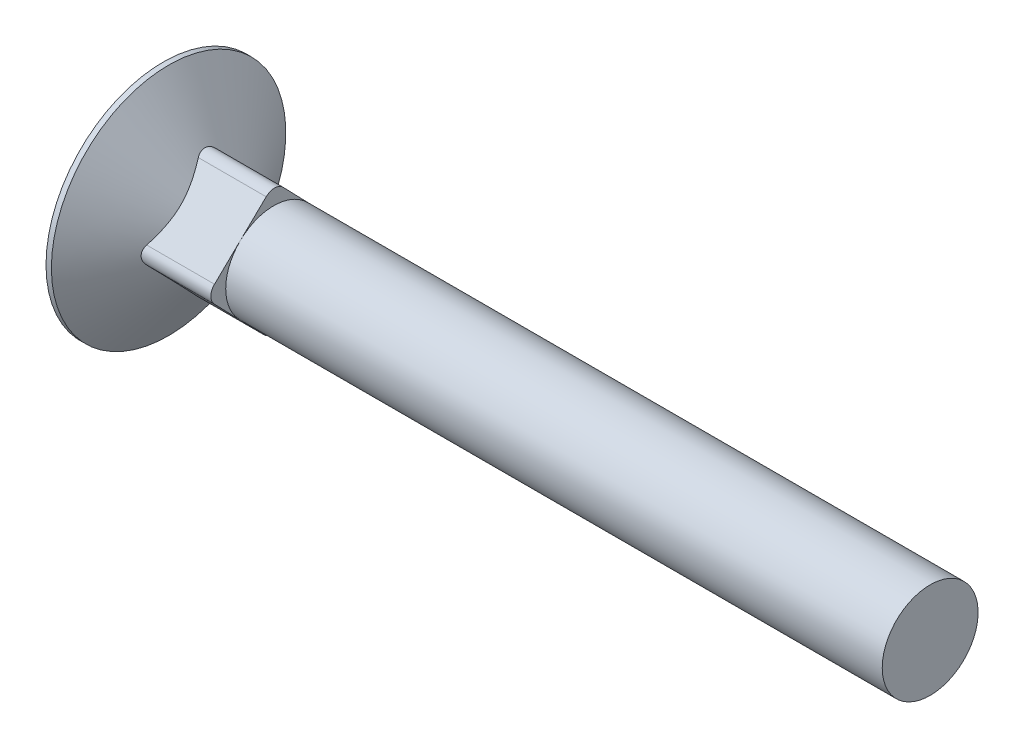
ISO-10303-21;
HEADER;
FILE_DESCRIPTION(('STEP AP214'),'2;1');
FILE_NAME('part.step','',(''),(''),'','','');
FILE_SCHEMA(('AUTOMOTIVE_DESIGN { 1 0 10303 214 1 1 1 1 }'));
ENDSEC;
DATA;
#1=APPLICATION_CONTEXT('core data for automotive mechanical design processes');
#2=APPLICATION_PROTOCOL_DEFINITION('international standard','automotive_design',2000,#1);
#3=PRODUCT_CONTEXT('',#1,'mechanical');
#4=PRODUCT('Part','Part','',(#3));
#5=PRODUCT_RELATED_PRODUCT_CATEGORY('part','',(#4));
#6=PRODUCT_DEFINITION_FORMATION('','',#4);
#7=PRODUCT_DEFINITION_CONTEXT('part definition',#1,'design');
#8=PRODUCT_DEFINITION('design','',#6,#7);
#9=PRODUCT_DEFINITION_SHAPE('','',#8);
#10=(LENGTH_UNIT() NAMED_UNIT(*) SI_UNIT(.MILLI.,.METRE.));
#11=(NAMED_UNIT(*) PLANE_ANGLE_UNIT() SI_UNIT($,.RADIAN.));
#12=(NAMED_UNIT(*) SI_UNIT($,.STERADIAN.) SOLID_ANGLE_UNIT());
#13=UNCERTAINTY_MEASURE_WITH_UNIT(LENGTH_MEASURE(1.E-05),#10,'distance_accuracy_value','');
#14=(GEOMETRIC_REPRESENTATION_CONTEXT(3) GLOBAL_UNCERTAINTY_ASSIGNED_CONTEXT((#13)) GLOBAL_UNIT_ASSIGNED_CONTEXT((#10,
#11,#12)) REPRESENTATION_CONTEXT('',''));
#15=CARTESIAN_POINT('',(0.,0.,0.));
#16=DIRECTION('',(0.,0.,1.));
#17=DIRECTION('',(1.,0.,0.));
#18=AXIS2_PLACEMENT_3D('',#15,#16,#17);
#19=CARTESIAN_POINT('',(0.533667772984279,0.,0.));
#20=DIRECTION('',(-1.,0.,0.));
#21=DIRECTION('',(0.,0.,1.));
#22=AXIS2_PLACEMENT_3D('',#19,#20,#21);
#23=CONICAL_SURFACE('',#22,11.6459,0.99483767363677);
#24=CARTESIAN_POINT('',(0.533667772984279,0.,0.));
#25=DIRECTION('',(-1.,0.,0.));
#26=DIRECTION('',(0.,0.,1.));
#27=AXIS2_PLACEMENT_3D('',#24,#25,#26);
#28=CIRCLE('',#27,11.6459);
#29=CARTESIAN_POINT('',(0.533667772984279,0.,11.6459));
#30=VERTEX_POINT('',#29);
#31=EDGE_CURVE('E218',#30,#30,#28,.T.);
#32=ORIENTED_EDGE('',*,*,#31,.F.);
#33=EDGE_LOOP('',(#32));
#34=FACE_BOUND('',#33,.T.);
#35=CARTESIAN_POINT('',(0.532123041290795,-10.9550309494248,-3.95849631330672));
#36=CARTESIAN_POINT('',(0.694883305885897,-10.7574427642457,-3.76768762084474));
#37=CARTESIAN_POINT('',(0.856904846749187,-10.559536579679,-3.57657183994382));
#38=CARTESIAN_POINT('',(1.17901780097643,-10.1628911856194,-3.19353583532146));
#39=CARTESIAN_POINT('',(1.33910905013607,-9.96415190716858,-3.00161554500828));
#40=CARTESIAN_POINT('',(1.65750023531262,-9.56490022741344,-2.61606267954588));
#41=CARTESIAN_POINT('',(1.815790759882,-9.36438393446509,-2.42242634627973));
#42=CARTESIAN_POINT('',(2.12924998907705,-8.96210112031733,-2.03394634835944));
#43=CARTESIAN_POINT('',(2.28441881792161,-8.76033464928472,-1.8391027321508));
#44=CARTESIAN_POINT('',(2.60253582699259,-8.33956733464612,-1.43277245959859));
#45=CARTESIAN_POINT('',(2.76515930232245,-8.12043891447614,-1.22116260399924));
#46=CARTESIAN_POINT('',(3.08403633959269,-7.67975137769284,-0.795595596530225));
#47=CARTESIAN_POINT('',(3.24028905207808,-7.45819194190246,-0.581638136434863));
#48=CARTESIAN_POINT('',(3.54365698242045,-7.01226444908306,-0.151010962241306));
#49=CARTESIAN_POINT('',(3.69078656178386,-6.78790151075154,0.0656538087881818));
#50=CARTESIAN_POINT('',(3.9018860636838,-6.4482959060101,0.393607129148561));
#51=CARTESIAN_POINT('',(3.97064730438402,-6.33459485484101,0.503406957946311));
#52=CARTESIAN_POINT('',(4.10429383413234,-6.10602334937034,0.724135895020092));
#53=CARTESIAN_POINT('',(4.16917940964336,-5.99115298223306,0.835064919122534));
#54=CARTESIAN_POINT('',(4.28177385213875,-5.78317650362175,1.03590546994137));
#55=CARTESIAN_POINT('',(4.33032469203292,-5.69030669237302,1.12558880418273));
#56=CARTESIAN_POINT('',(4.42392347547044,-5.50366905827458,1.30582267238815));
#57=CARTESIAN_POINT('',(4.46897188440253,-5.40990135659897,1.39637308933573));
#58=CARTESIAN_POINT('',(4.55500361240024,-5.22139771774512,1.57840893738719));
#59=CARTESIAN_POINT('',(4.59598693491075,-5.12666178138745,1.66989436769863));
#60=CARTESIAN_POINT('',(4.67326581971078,-4.93616450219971,1.85385545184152));
#61=CARTESIAN_POINT('',(4.70955912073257,-4.84040268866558,1.94633156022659));
#62=CARTESIAN_POINT('',(4.8091295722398,-4.55502583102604,2.22191678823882));
#63=CARTESIAN_POINT('',(4.86468926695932,-4.36393297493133,2.40645301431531));
#64=CARTESIAN_POINT('',(4.92839312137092,-4.07513434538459,2.68534260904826));
#65=CARTESIAN_POINT('',(4.94635423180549,-3.97851895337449,2.778643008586));
#66=CARTESIAN_POINT('',(4.97522467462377,-3.78474984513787,2.96576366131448));
#67=CARTESIAN_POINT('',(4.98613520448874,-3.68759622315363,3.05958382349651));
#68=CARTESIAN_POINT('',(5.00114339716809,-3.48493042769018,3.25529590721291));
#69=CARTESIAN_POINT('',(5.00460096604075,-3.37939330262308,3.35721192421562));
#70=CARTESIAN_POINT('',(5.00268671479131,-3.16837391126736,3.56099098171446));
#71=CARTESIAN_POINT('',(4.99731590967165,-3.06289164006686,3.66285402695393));
#72=CARTESIAN_POINT('',(4.9779534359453,-2.85227904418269,3.86624024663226));
#73=CARTESIAN_POINT('',(4.96395674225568,-2.74714896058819,3.96776318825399));
#74=CARTESIAN_POINT('',(4.92786642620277,-2.53761848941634,4.17010441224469));
#75=CARTESIAN_POINT('',(4.90577242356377,-2.43321813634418,4.27092266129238));
#76=CARTESIAN_POINT('',(4.82813110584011,-2.12026583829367,4.57313718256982));
#77=CARTESIAN_POINT('',(4.76134680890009,-1.91314141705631,4.77315491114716));
#78=CARTESIAN_POINT('',(4.60493800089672,-1.50360200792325,5.16864252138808));
#79=CARTESIAN_POINT('',(4.51531621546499,-1.30118646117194,5.36411294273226));
#80=CARTESIAN_POINT('',(4.38782773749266,-1.04048098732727,5.61587329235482));
#81=CARTESIAN_POINT('',(4.35750714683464,-0.980222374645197,5.67406435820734));
#82=CARTESIAN_POINT('',(4.29557102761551,-0.860252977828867,5.78991745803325));
#83=CARTESIAN_POINT('',(4.26395962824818,-0.800541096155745,5.84758055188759));
#84=CARTESIAN_POINT('',(4.13398057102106,-0.560445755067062,6.07943792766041));
#85=CARTESIAN_POINT('',(4.03052564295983,-0.381483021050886,6.25226023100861));
#86=CARTESIAN_POINT('',(3.81514593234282,-0.0262023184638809,6.59535081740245));
#87=CARTESIAN_POINT('',(3.70321920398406,0.150115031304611,6.76561850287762));
#88=CARTESIAN_POINT('',(3.47287138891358,0.500787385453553,7.10425885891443));
#89=CARTESIAN_POINT('',(3.35444275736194,0.675139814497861,7.27262904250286));
#90=CARTESIAN_POINT('',(3.11274095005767,1.02207115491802,7.60765674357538));
#91=CARTESIAN_POINT('',(2.98946819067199,1.1946502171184,7.77431440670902));
#92=CARTESIAN_POINT('',(2.73739552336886,1.54081564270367,8.10860247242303));
#93=CARTESIAN_POINT('',(2.6085421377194,1.71438179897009,8.27621336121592));
#94=CARTESIAN_POINT('',(2.34779855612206,2.06033522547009,8.61029670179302));
#95=CARTESIAN_POINT('',(2.21590824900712,2.23272245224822,8.77676911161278));
#96=CARTESIAN_POINT('',(1.95011606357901,2.57601874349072,9.10828648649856));
#97=CARTESIAN_POINT('',(1.81622133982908,2.74693068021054,9.27333422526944));
#98=CARTESIAN_POINT('',(1.54648946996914,3.08793964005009,9.60264274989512));
#99=CARTESIAN_POINT('',(1.41065250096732,3.2580367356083,9.76690360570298));
#100=CARTESIAN_POINT('',(1.27405768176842,3.42781483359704,9.93085640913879));
#101=B_SPLINE_CURVE_WITH_KNOTS('',3,(#35,#36,#37,#38,#39,#40,#41,#42,#43,#44,#45,#46,#47,#48,
#49,#50,#51,#52,#53,#54,#55,#56,#57,#58,#59,#60,#61,#62,#63,#64,#65,#66,#67,#68,#69,#70,#71,#72,
#73,#74,#75,#76,#77,#78,#79,#80,#81,#82,#83,#84,#85,#86,#87,#88,#89,#90,#91,#92,#93,#94,#95,#96,
#97,#98,#99,#100),.UNSPECIFIED.,.F.,.F.,(4,2,2,2,2,2,2,2,2,2,2,2,2,2,2,2,2,2,2,2,2,2,2,2,2,2,2,
2,2,2,2,2,4),(0.,0.95784549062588,1.91577189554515,2.87743116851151,3.83905209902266,
4.87493924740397,5.91096406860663,6.94531427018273,7.46239051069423,7.97942848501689,
8.39318007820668,8.80687659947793,9.22057277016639,9.63446766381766,10.4473829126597,
10.8537514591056,11.2600509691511,11.7000480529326,12.1399945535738,12.5801975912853,
13.0204213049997,13.9057728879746,14.7910188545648,15.0582778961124,15.3247403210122,
16.1328150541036,16.941075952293,17.7502954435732,18.5594455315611,19.3800254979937,
20.2006355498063,21.0188034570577,21.8368972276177),.UNSPECIFIED.);
#102=CARTESIAN_POINT('',(4.23183585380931,-5.87541843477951,0.946828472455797));
#103=VERTEX_POINT('',#102);
#104=CARTESIAN_POINT('',(4.23183585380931,-0.741202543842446,5.90488312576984));
#105=VERTEX_POINT('',#104);
#106=EDGE_CURVE('E220',#103,#105,#101,.T.);
#107=ORIENTED_EDGE('',*,*,#106,.T.);
#108=CARTESIAN_POINT('',(4.37943289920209,-0.944352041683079,5.64550263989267));
#109=CARTESIAN_POINT('',(4.35251225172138,-0.917354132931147,5.69204724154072));
#110=CARTESIAN_POINT('',(4.32662869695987,-0.886884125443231,5.73724384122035));
#111=CARTESIAN_POINT('',(4.27730445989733,-0.819163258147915,5.82401425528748));
#112=CARTESIAN_POINT('',(4.25387265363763,-0.781889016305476,5.86557482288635));
#113=CARTESIAN_POINT('',(4.20811926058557,-0.697414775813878,5.94718776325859));
#114=CARTESIAN_POINT('',(4.18606893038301,-0.649635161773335,5.98679887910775));
#115=CARTESIAN_POINT('',(4.1461706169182,-0.547346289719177,6.05870307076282));
#116=CARTESIAN_POINT('',(4.12831825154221,-0.49284414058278,6.09100377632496));
#117=CARTESIAN_POINT('',(4.09731214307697,-0.378030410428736,6.14704165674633));
#118=CARTESIAN_POINT('',(4.08417889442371,-0.317694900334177,6.1707414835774));
#119=CARTESIAN_POINT('',(4.06322968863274,-0.193106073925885,6.2081677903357));
#120=CARTESIAN_POINT('',(4.05541340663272,-0.128852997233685,6.22189487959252));
#121=CARTESIAN_POINT('',(4.04574485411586,-0.002640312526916,6.23807479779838));
#122=CARTESIAN_POINT('',(4.04354853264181,0.0592095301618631,6.24118215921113));
#123=CARTESIAN_POINT('',(4.04420106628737,0.182610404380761,6.23778541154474));
#124=CARTESIAN_POINT('',(4.04704886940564,0.244161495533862,6.23128330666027));
#125=CARTESIAN_POINT('',(4.05748932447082,0.362978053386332,6.20936879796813));
#126=CARTESIAN_POINT('',(4.06491236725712,0.420318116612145,6.19427631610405));
#127=CARTESIAN_POINT('',(4.0840854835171,0.531468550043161,6.15609939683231));
#128=CARTESIAN_POINT('',(4.09583456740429,0.585279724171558,6.13301678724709));
#129=CARTESIAN_POINT('',(4.12522430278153,0.695392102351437,6.0760331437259));
#130=CARTESIAN_POINT('',(4.14345974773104,0.750985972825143,6.04106952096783));
#131=CARTESIAN_POINT('',(4.1844626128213,0.854790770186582,5.96348587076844));
#132=CARTESIAN_POINT('',(4.20724090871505,0.902983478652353,5.92084749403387));
#133=CARTESIAN_POINT('',(4.26048053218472,0.997893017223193,5.82250913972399));
#134=CARTESIAN_POINT('',(4.29158558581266,1.0432204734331,5.7658090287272));
#135=CARTESIAN_POINT('',(4.34119373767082,1.10229290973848,5.6768498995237));
#136=CARTESIAN_POINT('',(4.35819619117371,1.12047838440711,5.64658957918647));
#137=CARTESIAN_POINT('',(4.39308026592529,1.15391048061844,5.58501172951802));
#138=CARTESIAN_POINT('',(4.41096112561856,1.16915959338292,5.55369512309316));
#139=CARTESIAN_POINT('',(4.42923880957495,1.18295598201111,5.52195706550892));
#140=B_SPLINE_CURVE_WITH_KNOTS('',3,(#108,#109,#110,#111,#112,#113,#114,#115,#116,#117,#118,
#119,#120,#121,#122,#123,#124,#125,#126,#127,#128,#129,#130,#131,#132,#133,#134,#135,#136,#137,
#138,#139),.UNSPECIFIED.,.F.,.F.,(4,2,2,2,2,2,2,2,2,2,2,2,2,2,2,4),(0.,0.180452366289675,
0.361536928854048,0.558281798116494,0.754820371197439,0.952202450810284,1.14957246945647,
1.33453429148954,1.51945754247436,1.69790657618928,1.87631481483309,2.07971777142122,
2.28361365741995,2.51914795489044,2.63659303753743,2.75393803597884),.UNSPECIFIED.);
#141=CARTESIAN_POINT('',(4.23183585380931,0.946828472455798,5.87541843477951));
#142=VERTEX_POINT('',#141);
#143=EDGE_CURVE('E11',#105,#142,#140,.T.);
#144=ORIENTED_EDGE('',*,*,#143,.T.);
#145=CARTESIAN_POINT('',(4.23172373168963,0.946628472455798,5.87562554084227));
#146=CARTESIAN_POINT('',(4.23172501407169,0.946630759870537,5.87562317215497));
#147=CARTESIAN_POINT('',(4.23172629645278,0.94663304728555,5.87562080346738));
#148=CARTESIAN_POINT('',(4.33105429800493,1.12380702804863,5.69215177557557));
#149=CARTESIAN_POINT('',(4.42452513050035,1.30262022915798,5.50698528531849));
#150=CARTESIAN_POINT('',(4.59558532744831,1.66399022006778,5.13277570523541));
#151=CARTESIAN_POINT('',(4.67316867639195,1.84654839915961,4.94373117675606));
#152=CARTESIAN_POINT('',(4.80695165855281,2.21499956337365,4.56218882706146));
#153=CARTESIAN_POINT('',(4.86321175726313,2.40088152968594,4.36970241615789));
#154=CARTESIAN_POINT('',(4.92769282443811,2.68184225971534,4.07875906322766));
#155=CARTESIAN_POINT('',(4.94586710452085,2.77583793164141,3.98142369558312));
#156=CARTESIAN_POINT('',(4.97506088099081,2.96435811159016,3.78620533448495));
#157=CARTESIAN_POINT('',(4.98608152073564,3.05888253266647,3.68832243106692));
#158=CARTESIAN_POINT('',(5.00115348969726,3.25542884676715,3.48479276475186));
#159=CARTESIAN_POINT('',(5.00460972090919,3.35747316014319,3.37912278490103));
#160=CARTESIAN_POINT('',(5.00267047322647,3.56152198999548,3.16782403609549));
#161=CARTESIAN_POINT('',(4.99727481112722,3.66352650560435,3.06219526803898));
#162=CARTESIAN_POINT('',(4.97783944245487,3.86719479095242,2.8512905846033));
#163=CARTESIAN_POINT('',(4.96379460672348,3.96885832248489,2.74601491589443));
#164=CARTESIAN_POINT('',(4.92758835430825,4.17147478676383,2.53619942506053));
#165=CARTESIAN_POINT('',(4.90542678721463,4.27242770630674,2.43165961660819));
#166=CARTESIAN_POINT('',(4.82769922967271,4.57449465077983,2.11886013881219));
#167=CARTESIAN_POINT('',(4.76095322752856,4.77423466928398,1.912023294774));
#168=CARTESIAN_POINT('',(4.60469352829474,5.16917536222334,1.50305023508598));
#169=CARTESIAN_POINT('',(4.51518309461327,5.3643766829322,1.30091335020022));
#170=CARTESIAN_POINT('',(4.38785827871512,5.61581272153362,1.04054371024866));
#171=CARTESIAN_POINT('',(4.35756939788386,5.67394416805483,0.980346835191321));
#172=CARTESIAN_POINT('',(4.29563627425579,5.7897991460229,0.860375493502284));
#173=CARTESIAN_POINT('',(4.26399332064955,5.84752300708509,0.800600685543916));
#174=CARTESIAN_POINT('',(4.23172629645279,5.90507855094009,0.741000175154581));
#175=CARTESIAN_POINT('',(4.2317250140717,5.9050808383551,0.740997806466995));
#176=CARTESIAN_POINT('',(4.23172373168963,5.90508312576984,0.740995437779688));
#177=B_SPLINE_CURVE_WITH_KNOTS('',3,(#145,#146,#147,#148,#149,#150,#151,#152,#153,#154,#155,
#156,#157,#158,#159,#160,#161,#162,#163,#164,#165,#166,#167,#168,#169,#170,#171,#172,#173,#174,
#175,#176),.UNSPECIFIED.,.F.,.F.,(4,2,2,2,2,2,2,2,2,2,2,2,2,2,2,4),(0.,1.06012756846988E-05,
0.82113214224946,1.64256401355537,2.46164883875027,2.87106894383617,3.28042359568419,
3.72097324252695,4.16153200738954,4.60235228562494,5.04318073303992,5.92734592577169,
6.81138443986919,7.07837005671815,7.34510690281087,7.34511750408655),.UNSPECIFIED.);
#178=CARTESIAN_POINT('',(4.23183585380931,5.90488312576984,0.741202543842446));
#179=VERTEX_POINT('',#178);
#180=EDGE_CURVE('E227',#142,#179,#177,.T.);
#181=ORIENTED_EDGE('',*,*,#180,.T.);
#182=CARTESIAN_POINT('',(4.37943289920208,5.64550263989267,0.944352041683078));
#183=CARTESIAN_POINT('',(4.35251225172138,5.69204724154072,0.917354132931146));
#184=CARTESIAN_POINT('',(4.32662869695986,5.73724384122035,0.88688412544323));
#185=CARTESIAN_POINT('',(4.27730445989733,5.82401425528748,0.819163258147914));
#186=CARTESIAN_POINT('',(4.25387265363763,5.86557482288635,0.781889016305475));
#187=CARTESIAN_POINT('',(4.20811926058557,5.9471877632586,0.697414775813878));
#188=CARTESIAN_POINT('',(4.18606893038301,5.98679887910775,0.649635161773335));
#189=CARTESIAN_POINT('',(4.1461706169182,6.05870307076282,0.547346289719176));
#190=CARTESIAN_POINT('',(4.12831825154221,6.09100377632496,0.49284414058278));
#191=CARTESIAN_POINT('',(4.09731214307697,6.14704165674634,0.378030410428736));
#192=CARTESIAN_POINT('',(4.08417889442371,6.1707414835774,0.317694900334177));
#193=CARTESIAN_POINT('',(4.06322968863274,6.2081677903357,0.193106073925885));
#194=CARTESIAN_POINT('',(4.05541340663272,6.22189487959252,0.128852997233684));
#195=CARTESIAN_POINT('',(4.04574485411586,6.23807479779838,0.00264031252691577));
#196=CARTESIAN_POINT('',(4.04354853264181,6.24118215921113,-0.0592095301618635));
#197=CARTESIAN_POINT('',(4.04420106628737,6.23778541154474,-0.182610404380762));
#198=CARTESIAN_POINT('',(4.04704886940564,6.23128330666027,-0.244161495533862));
#199=CARTESIAN_POINT('',(4.05748932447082,6.20936879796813,-0.362978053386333));
#200=CARTESIAN_POINT('',(4.06491236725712,6.19427631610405,-0.420318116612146));
#201=CARTESIAN_POINT('',(4.0840854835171,6.15609939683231,-0.531468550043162));
#202=CARTESIAN_POINT('',(4.09583456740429,6.13301678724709,-0.585279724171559));
#203=CARTESIAN_POINT('',(4.12522430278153,6.0760331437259,-0.695392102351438));
#204=CARTESIAN_POINT('',(4.14345974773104,6.04106952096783,-0.750985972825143));
#205=CARTESIAN_POINT('',(4.1844626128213,5.96348587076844,-0.854790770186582));
#206=CARTESIAN_POINT('',(4.20724090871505,5.92084749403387,-0.902983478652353));
#207=CARTESIAN_POINT('',(4.26048053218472,5.82250913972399,-0.997893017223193));
#208=CARTESIAN_POINT('',(4.29158558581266,5.7658090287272,-1.0432204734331));
#209=CARTESIAN_POINT('',(4.34119373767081,5.6768498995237,-1.10229290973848));
#210=CARTESIAN_POINT('',(4.35819619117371,5.64658957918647,-1.12047838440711));
#211=CARTESIAN_POINT('',(4.39308026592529,5.58501172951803,-1.15391048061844));
#212=CARTESIAN_POINT('',(4.41096112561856,5.55369512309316,-1.16915959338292));
#213=CARTESIAN_POINT('',(4.42923880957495,5.52195706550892,-1.18295598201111));
#214=B_SPLINE_CURVE_WITH_KNOTS('',3,(#182,#183,#184,#185,#186,#187,#188,#189,#190,#191,#192,
#193,#194,#195,#196,#197,#198,#199,#200,#201,#202,#203,#204,#205,#206,#207,#208,#209,#210,#211,
#212,#213),.UNSPECIFIED.,.F.,.F.,(4,2,2,2,2,2,2,2,2,2,2,2,2,2,2,4),(0.,0.180452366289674,
0.361536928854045,0.558281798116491,0.754820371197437,0.952202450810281,1.14957246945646,
1.33453429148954,1.51945754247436,1.69790657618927,1.87631481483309,2.07971777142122,
2.28361365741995,2.51914795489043,2.63659303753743,2.75393803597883),.UNSPECIFIED.);
#215=CARTESIAN_POINT('',(4.23183585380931,5.87541843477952,-0.946828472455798));
#216=VERTEX_POINT('',#215);
#217=EDGE_CURVE('E139',#179,#216,#214,.T.);
#218=ORIENTED_EDGE('',*,*,#217,.T.);
#219=CARTESIAN_POINT('',(0.532123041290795,10.9550309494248,3.95849631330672));
#220=CARTESIAN_POINT('',(0.694883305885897,10.7574427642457,3.76768762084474));
#221=CARTESIAN_POINT('',(0.856904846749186,10.559536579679,3.57657183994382));
#222=CARTESIAN_POINT('',(1.17901780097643,10.1628911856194,3.19353583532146));
#223=CARTESIAN_POINT('',(1.33910905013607,9.96415190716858,3.00161554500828));
#224=CARTESIAN_POINT('',(1.65750023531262,9.56490022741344,2.61606267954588));
#225=CARTESIAN_POINT('',(1.815790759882,9.36438393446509,2.42242634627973));
#226=CARTESIAN_POINT('',(2.12924998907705,8.96210112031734,2.03394634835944));
#227=CARTESIAN_POINT('',(2.28441881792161,8.76033464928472,1.8391027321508));
#228=CARTESIAN_POINT('',(2.60253582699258,8.33956733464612,1.43277245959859));
#229=CARTESIAN_POINT('',(2.76515930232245,8.12043891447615,1.22116260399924));
#230=CARTESIAN_POINT('',(3.08403633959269,7.67975137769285,0.795595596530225));
#231=CARTESIAN_POINT('',(3.24028905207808,7.45819194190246,0.581638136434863));
#232=CARTESIAN_POINT('',(3.54365698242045,7.01226444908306,0.151010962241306));
#233=CARTESIAN_POINT('',(3.69078656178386,6.78790151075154,-0.0656538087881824));
#234=CARTESIAN_POINT('',(3.9018860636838,6.4482959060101,-0.393607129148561));
#235=CARTESIAN_POINT('',(3.97064730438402,6.33459485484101,-0.503406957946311));
#236=CARTESIAN_POINT('',(4.10429383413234,6.10602334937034,-0.724135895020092));
#237=CARTESIAN_POINT('',(4.16917940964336,5.99115298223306,-0.835064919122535));
#238=CARTESIAN_POINT('',(4.28177385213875,5.78317650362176,-1.03590546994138));
#239=CARTESIAN_POINT('',(4.33032469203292,5.69030669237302,-1.12558880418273));
#240=CARTESIAN_POINT('',(4.42392347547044,5.50366905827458,-1.30582267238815));
#241=CARTESIAN_POINT('',(4.46897188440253,5.40990135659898,-1.39637308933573));
#242=CARTESIAN_POINT('',(4.55500361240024,5.22139771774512,-1.57840893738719));
#243=CARTESIAN_POINT('',(4.59598693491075,5.12666178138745,-1.66989436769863));
#244=CARTESIAN_POINT('',(4.67326581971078,4.93616450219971,-1.85385545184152));
#245=CARTESIAN_POINT('',(4.70955912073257,4.84040268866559,-1.94633156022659));
#246=CARTESIAN_POINT('',(4.80912957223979,4.55502583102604,-2.22191678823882));
#247=CARTESIAN_POINT('',(4.86468926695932,4.36393297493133,-2.4064530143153));
#248=CARTESIAN_POINT('',(4.92839312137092,4.07513434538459,-2.68534260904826));
#249=CARTESIAN_POINT('',(4.94635423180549,3.97851895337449,-2.778643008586));
#250=CARTESIAN_POINT('',(4.97522467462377,3.78474984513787,-2.96576366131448));
#251=CARTESIAN_POINT('',(4.98613520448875,3.68759622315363,-3.05958382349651));
#252=CARTESIAN_POINT('',(5.00114339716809,3.48493042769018,-3.25529590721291));
#253=CARTESIAN_POINT('',(5.00460096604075,3.37939330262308,-3.35721192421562));
#254=CARTESIAN_POINT('',(5.00268671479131,3.16837391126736,-3.56099098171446));
#255=CARTESIAN_POINT('',(4.99731590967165,3.06289164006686,-3.66285402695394));
#256=CARTESIAN_POINT('',(4.9779534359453,2.85227904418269,-3.86624024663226));
#257=CARTESIAN_POINT('',(4.96395674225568,2.74714896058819,-3.96776318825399));
#258=CARTESIAN_POINT('',(4.92786642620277,2.53761848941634,-4.17010441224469));
#259=CARTESIAN_POINT('',(4.90577242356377,2.43321813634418,-4.27092266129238));
#260=CARTESIAN_POINT('',(4.82813110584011,2.12026583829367,-4.57313718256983));
#261=CARTESIAN_POINT('',(4.76134680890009,1.91314141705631,-4.77315491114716));
#262=CARTESIAN_POINT('',(4.60493800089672,1.50360200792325,-5.16864252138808));
#263=CARTESIAN_POINT('',(4.51531621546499,1.30118646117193,-5.36411294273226));
#264=CARTESIAN_POINT('',(4.38782773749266,1.04048098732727,-5.61587329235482));
#265=CARTESIAN_POINT('',(4.35750714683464,0.980222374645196,-5.67406435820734));
#266=CARTESIAN_POINT('',(4.29557102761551,0.860252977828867,-5.78991745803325));
#267=CARTESIAN_POINT('',(4.26395962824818,0.800541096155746,-5.84758055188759));
#268=CARTESIAN_POINT('',(4.13398057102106,0.560445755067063,-6.07943792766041));
#269=CARTESIAN_POINT('',(4.03052564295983,0.381483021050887,-6.25226023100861));
#270=CARTESIAN_POINT('',(3.81514593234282,0.0262023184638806,-6.59535081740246));
#271=CARTESIAN_POINT('',(3.70321920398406,-0.150115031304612,-6.76561850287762));
#272=CARTESIAN_POINT('',(3.47287138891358,-0.500787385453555,-7.10425885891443));
#273=CARTESIAN_POINT('',(3.35444275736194,-0.675139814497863,-7.27262904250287));
#274=CARTESIAN_POINT('',(3.11274095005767,-1.02207115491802,-7.60765674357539));
#275=CARTESIAN_POINT('',(2.98946819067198,-1.1946502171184,-7.77431440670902));
#276=CARTESIAN_POINT('',(2.73739552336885,-1.54081564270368,-8.10860247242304));
#277=CARTESIAN_POINT('',(2.60854213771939,-1.71438179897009,-8.27621336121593));
#278=CARTESIAN_POINT('',(2.34779855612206,-2.06033522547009,-8.61029670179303));
#279=CARTESIAN_POINT('',(2.21590824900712,-2.23272245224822,-8.77676911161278));
#280=CARTESIAN_POINT('',(1.95011606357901,-2.57601874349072,-9.10828648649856));
#281=CARTESIAN_POINT('',(1.81622133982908,-2.74693068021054,-9.27333422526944));
#282=CARTESIAN_POINT('',(1.54648946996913,-3.08793964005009,-9.60264274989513));
#283=CARTESIAN_POINT('',(1.41065250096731,-3.25803673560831,-9.76690360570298));
#284=CARTESIAN_POINT('',(1.27405768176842,-3.42781483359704,-9.9308564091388));
#285=B_SPLINE_CURVE_WITH_KNOTS('',3,(#219,#220,#221,#222,#223,#224,#225,#226,#227,#228,#229,
#230,#231,#232,#233,#234,#235,#236,#237,#238,#239,#240,#241,#242,#243,#244,#245,#246,#247,#248,
#249,#250,#251,#252,#253,#254,#255,#256,#257,#258,#259,#260,#261,#262,#263,#264,#265,#266,#267,
#268,#269,#270,#271,#272,#273,#274,#275,#276,#277,#278,#279,#280,#281,#282,#283,#284),
.UNSPECIFIED.,.F.,.F.,(4,2,2,2,2,2,2,2,2,2,2,2,2,2,2,2,2,2,2,2,2,2,2,2,2,2,2,2,2,2,2,2,4),(0.,
0.957845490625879,1.91577189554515,2.87743116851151,3.83905209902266,4.87493924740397,
5.91096406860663,6.94531427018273,7.46239051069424,7.97942848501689,8.39318007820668,
8.80687659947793,9.22057277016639,9.63446766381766,10.4473829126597,10.8537514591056,
11.2600509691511,11.7000480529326,12.1399945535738,12.5801975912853,13.0204213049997,
13.9057728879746,14.7910188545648,15.0582778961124,15.3247403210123,16.1328150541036,
16.941075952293,17.7502954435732,18.5594455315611,19.3800254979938,20.2006355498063,
21.0188034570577,21.8368972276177),.UNSPECIFIED.);
#286=CARTESIAN_POINT('',(4.23183585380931,0.741202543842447,-5.90488312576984));
#287=VERTEX_POINT('',#286);
#288=EDGE_CURVE('E53',#216,#287,#285,.T.);
#289=ORIENTED_EDGE('',*,*,#288,.T.);
#290=CARTESIAN_POINT('',(4.37943289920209,0.94435204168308,-5.64550263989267));
#291=CARTESIAN_POINT('',(4.35251225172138,0.917354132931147,-5.69204724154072));
#292=CARTESIAN_POINT('',(4.32662869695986,0.886884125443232,-5.73724384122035));
#293=CARTESIAN_POINT('',(4.27730445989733,0.819163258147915,-5.82401425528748));
#294=CARTESIAN_POINT('',(4.25387265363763,0.781889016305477,-5.86557482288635));
#295=CARTESIAN_POINT('',(4.20811926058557,0.697414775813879,-5.94718776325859));
#296=CARTESIAN_POINT('',(4.18606893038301,0.649635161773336,-5.98679887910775));
#297=CARTESIAN_POINT('',(4.1461706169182,0.547346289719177,-6.05870307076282));
#298=CARTESIAN_POINT('',(4.12831825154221,0.492844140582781,-6.09100377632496));
#299=CARTESIAN_POINT('',(4.09731214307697,0.378030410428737,-6.14704165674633));
#300=CARTESIAN_POINT('',(4.08417889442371,0.317694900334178,-6.1707414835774));
#301=CARTESIAN_POINT('',(4.06322968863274,0.193106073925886,-6.2081677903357));
#302=CARTESIAN_POINT('',(4.05541340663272,0.128852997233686,-6.22189487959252));
#303=CARTESIAN_POINT('',(4.04574485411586,0.00264031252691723,-6.23807479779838));
#304=CARTESIAN_POINT('',(4.04354853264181,-0.059209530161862,-6.24118215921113));
#305=CARTESIAN_POINT('',(4.04420106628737,-0.18261040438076,-6.23778541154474));
#306=CARTESIAN_POINT('',(4.04704886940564,-0.244161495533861,-6.23128330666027));
#307=CARTESIAN_POINT('',(4.05748932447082,-0.362978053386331,-6.20936879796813));
#308=CARTESIAN_POINT('',(4.06491236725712,-0.420318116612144,-6.19427631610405));
#309=CARTESIAN_POINT('',(4.0840854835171,-0.53146855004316,-6.15609939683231));
#310=CARTESIAN_POINT('',(4.09583456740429,-0.585279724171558,-6.13301678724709));
#311=CARTESIAN_POINT('',(4.12522430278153,-0.695392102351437,-6.0760331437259));
#312=CARTESIAN_POINT('',(4.14345974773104,-0.750985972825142,-6.04106952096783));
#313=CARTESIAN_POINT('',(4.1844626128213,-0.854790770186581,-5.96348587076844));
#314=CARTESIAN_POINT('',(4.20724090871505,-0.902983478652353,-5.92084749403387));
#315=CARTESIAN_POINT('',(4.26048053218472,-0.997893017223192,-5.82250913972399));
#316=CARTESIAN_POINT('',(4.29158558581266,-1.04322047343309,-5.7658090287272));
#317=CARTESIAN_POINT('',(4.34119373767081,-1.10229290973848,-5.6768498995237));
#318=CARTESIAN_POINT('',(4.35819619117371,-1.12047838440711,-5.64658957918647));
#319=CARTESIAN_POINT('',(4.39308026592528,-1.15391048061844,-5.58501172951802));
#320=CARTESIAN_POINT('',(4.41096112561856,-1.16915959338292,-5.55369512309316));
#321=CARTESIAN_POINT('',(4.42923880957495,-1.18295598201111,-5.52195706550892));
#322=B_SPLINE_CURVE_WITH_KNOTS('',3,(#290,#291,#292,#293,#294,#295,#296,#297,#298,#299,#300,
#301,#302,#303,#304,#305,#306,#307,#308,#309,#310,#311,#312,#313,#314,#315,#316,#317,#318,#319,
#320,#321),.UNSPECIFIED.,.F.,.F.,(4,2,2,2,2,2,2,2,2,2,2,2,2,2,2,4),(0.,0.180452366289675,
0.361536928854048,0.558281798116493,0.754820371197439,0.952202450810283,1.14957246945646,
1.33453429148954,1.51945754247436,1.69790657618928,1.87631481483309,2.07971777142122,
2.28361365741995,2.51914795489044,2.63659303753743,2.75393803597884),.UNSPECIFIED.);
#323=CARTESIAN_POINT('',(4.23183585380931,-0.946828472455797,-5.87541843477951));
#324=VERTEX_POINT('',#323);
#325=EDGE_CURVE('E177',#287,#324,#322,.T.);
#326=ORIENTED_EDGE('',*,*,#325,.T.);
#327=CARTESIAN_POINT('',(4.23172373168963,-0.946628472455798,-5.87562554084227));
#328=CARTESIAN_POINT('',(4.23172501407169,-0.946630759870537,-5.87562317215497));
#329=CARTESIAN_POINT('',(4.23172629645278,-0.94663304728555,-5.87562080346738));
#330=CARTESIAN_POINT('',(4.3310542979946,-1.12380702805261,-5.69215177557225));
#331=CARTESIAN_POINT('',(4.42452513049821,-1.30262022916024,-5.50698528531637));
#332=CARTESIAN_POINT('',(4.59558532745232,-1.66399022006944,-5.13277570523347));
#333=CARTESIAN_POINT('',(4.67316867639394,-1.84654839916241,-4.94373117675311));
#334=CARTESIAN_POINT('',(4.80695165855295,-2.21499956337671,-4.56218882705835));
#335=CARTESIAN_POINT('',(4.86321175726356,-2.40088152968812,-4.36970241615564));
#336=CARTESIAN_POINT('',(4.92769282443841,-2.68184225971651,-4.07875906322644));
#337=CARTESIAN_POINT('',(4.94586710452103,-2.77583793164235,-3.98142369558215));
#338=CARTESIAN_POINT('',(4.97506088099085,-2.96435811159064,-3.78620533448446));
#339=CARTESIAN_POINT('',(4.98608152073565,-3.05888253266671,-3.68832243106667));
#340=CARTESIAN_POINT('',(5.00115348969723,-3.25542884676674,-3.48479276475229));
#341=CARTESIAN_POINT('',(5.00460972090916,-3.35747316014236,-3.37912278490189));
#342=CARTESIAN_POINT('',(5.00267047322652,-3.56152198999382,-3.16782403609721));
#343=CARTESIAN_POINT('',(4.99727481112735,-3.66352650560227,-3.06219526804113));
#344=CARTESIAN_POINT('',(4.97783944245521,-3.86719479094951,-2.85129058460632));
#345=CARTESIAN_POINT('',(4.96379460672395,-3.96885832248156,-2.7460149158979));
#346=CARTESIAN_POINT('',(4.92758835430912,-4.17147478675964,-2.53619942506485));
#347=CARTESIAN_POINT('',(4.90542678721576,-4.27242770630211,-2.43165961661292));
#348=CARTESIAN_POINT('',(4.82769922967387,-4.57449465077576,-2.11886013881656));
#349=CARTESIAN_POINT('',(4.76095322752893,-4.77423466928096,-1.91202329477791));
#350=CARTESIAN_POINT('',(4.60469352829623,-5.16917536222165,-1.50305023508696));
#351=CARTESIAN_POINT('',(4.51518309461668,-5.36437668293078,-1.30091335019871));
#352=CARTESIAN_POINT('',(4.38785827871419,-5.61581272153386,-1.04054371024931));
#353=CARTESIAN_POINT('',(4.35756939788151,-5.67394416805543,-0.980346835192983));
#354=CARTESIAN_POINT('',(4.29563627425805,-5.78979914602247,-0.86037549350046));
#355=CARTESIAN_POINT('',(4.26399332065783,-5.84752300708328,-0.8006006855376));
#356=CARTESIAN_POINT('',(4.23172629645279,-5.90507855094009,-0.741000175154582));
#357=CARTESIAN_POINT('',(4.2317250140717,-5.9050808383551,-0.740997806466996));
#358=CARTESIAN_POINT('',(4.23172373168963,-5.90508312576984,-0.74099543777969));
#359=B_SPLINE_CURVE_WITH_KNOTS('',3,(#327,#328,#329,#330,#331,#332,#333,#334,#335,#336,#337,
#338,#339,#340,#341,#342,#343,#344,#345,#346,#347,#348,#349,#350,#351,#352,#353,#354,#355,#356,
#357,#358),.UNSPECIFIED.,.F.,.F.,(4,2,2,2,2,2,2,2,2,2,2,2,2,2,2,4),(0.,1.06012756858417E-05,
0.821132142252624,1.64256401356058,2.46164883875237,2.87106894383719,3.2804235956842,
3.72097324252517,4.16153200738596,4.6023522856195,5.04318073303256,5.92734592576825,
6.81138443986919,7.07837005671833,7.34510690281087,7.34511750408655),.UNSPECIFIED.);
#360=CARTESIAN_POINT('',(4.23183585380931,-5.90488312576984,-0.741202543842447));
#361=VERTEX_POINT('',#360);
#362=EDGE_CURVE('E142',#324,#361,#359,.T.);
#363=ORIENTED_EDGE('',*,*,#362,.T.);
#364=CARTESIAN_POINT('',(4.37943289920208,-5.64550263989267,-0.944352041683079));
#365=CARTESIAN_POINT('',(4.35251225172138,-5.69204724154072,-0.917354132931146));
#366=CARTESIAN_POINT('',(4.32662869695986,-5.73724384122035,-0.886884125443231));
#367=CARTESIAN_POINT('',(4.27730445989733,-5.82401425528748,-0.819163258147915));
#368=CARTESIAN_POINT('',(4.25387265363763,-5.86557482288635,-0.781889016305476));
#369=CARTESIAN_POINT('',(4.20811926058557,-5.94718776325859,-0.697414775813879));
#370=CARTESIAN_POINT('',(4.18606893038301,-5.98679887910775,-0.649635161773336));
#371=CARTESIAN_POINT('',(4.1461706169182,-6.05870307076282,-0.547346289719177));
#372=CARTESIAN_POINT('',(4.12831825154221,-6.09100377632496,-0.492844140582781));
#373=CARTESIAN_POINT('',(4.09731214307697,-6.14704165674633,-0.378030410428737));
#374=CARTESIAN_POINT('',(4.08417889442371,-6.1707414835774,-0.317694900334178));
#375=CARTESIAN_POINT('',(4.06322968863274,-6.2081677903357,-0.193106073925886));
#376=CARTESIAN_POINT('',(4.05541340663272,-6.22189487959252,-0.128852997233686));
#377=CARTESIAN_POINT('',(4.04574485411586,-6.23807479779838,-0.00264031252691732));
#378=CARTESIAN_POINT('',(4.04354853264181,-6.24118215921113,0.0592095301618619));
#379=CARTESIAN_POINT('',(4.04420106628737,-6.23778541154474,0.18261040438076));
#380=CARTESIAN_POINT('',(4.04704886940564,-6.23128330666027,0.244161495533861));
#381=CARTESIAN_POINT('',(4.05748932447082,-6.20936879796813,0.362978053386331));
#382=CARTESIAN_POINT('',(4.06491236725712,-6.19427631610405,0.420318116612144));
#383=CARTESIAN_POINT('',(4.0840854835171,-6.15609939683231,0.53146855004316));
#384=CARTESIAN_POINT('',(4.09583456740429,-6.13301678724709,0.585279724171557));
#385=CARTESIAN_POINT('',(4.12522430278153,-6.0760331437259,0.695392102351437));
#386=CARTESIAN_POINT('',(4.14345974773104,-6.04106952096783,0.750985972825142));
#387=CARTESIAN_POINT('',(4.1844626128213,-5.96348587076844,0.854790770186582));
#388=CARTESIAN_POINT('',(4.20724090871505,-5.92084749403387,0.902983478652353));
#389=CARTESIAN_POINT('',(4.26048053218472,-5.82250913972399,0.997893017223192));
#390=CARTESIAN_POINT('',(4.29158558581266,-5.7658090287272,1.04322047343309));
#391=CARTESIAN_POINT('',(4.34119373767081,-5.6768498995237,1.10229290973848));
#392=CARTESIAN_POINT('',(4.35819619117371,-5.64658957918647,1.12047838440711));
#393=CARTESIAN_POINT('',(4.39308026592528,-5.58501172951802,1.15391048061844));
#394=CARTESIAN_POINT('',(4.41096112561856,-5.55369512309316,1.16915959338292));
#395=CARTESIAN_POINT('',(4.42923880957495,-5.52195706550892,1.18295598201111));
#396=B_SPLINE_CURVE_WITH_KNOTS('',3,(#364,#365,#366,#367,#368,#369,#370,#371,#372,#373,#374,
#375,#376,#377,#378,#379,#380,#381,#382,#383,#384,#385,#386,#387,#388,#389,#390,#391,#392,#393,
#394,#395),.UNSPECIFIED.,.F.,.F.,(4,2,2,2,2,2,2,2,2,2,2,2,2,2,2,4),(0.,0.180452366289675,
0.361536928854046,0.558281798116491,0.754820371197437,0.952202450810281,1.14957246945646,
1.33453429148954,1.51945754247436,1.69790657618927,1.87631481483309,2.07971777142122,
2.28361365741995,2.51914795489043,2.63659303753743,2.75393803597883),.UNSPECIFIED.);
#397=EDGE_CURVE('E46',#361,#103,#396,.T.);
#398=ORIENTED_EDGE('',*,*,#397,.T.);
#399=EDGE_LOOP('',(#107,#144,#181,#218,#289,#326,#363,#398));
#400=FACE_BOUND('',#399,.T.);
#401=ADVANCED_FACE('F33',(#34,#400),#23,.T.);
#402=CARTESIAN_POINT('',(0.,0.,0.));
#403=DIRECTION('',(-1.,0.,0.));
#404=DIRECTION('',(0.,0.,1.));
#405=AXIS2_PLACEMENT_3D('',#402,#403,#404);
#406=PLANE('',#405);
#407=CARTESIAN_POINT('',(0.,0.,0.));
#408=DIRECTION('',(-1.,0.,0.));
#409=DIRECTION('',(0.,0.,1.));
#410=AXIS2_PLACEMENT_3D('',#407,#408,#409);
#411=CIRCLE('',#410,11.6459);
#412=CARTESIAN_POINT('',(0.,0.,11.6459));
#413=VERTEX_POINT('',#412);
#414=EDGE_CURVE('E272',#413,#413,#411,.T.);
#415=ORIENTED_EDGE('',*,*,#414,.T.);
#416=EDGE_LOOP('',(#415));
#417=FACE_BOUND('',#416,.T.);
#418=ADVANCED_FACE('F35',(#417),#406,.T.);
#419=CARTESIAN_POINT('',(-6.34999999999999,0.,0.));
#420=DIRECTION('',(-1.,0.,0.));
#421=DIRECTION('',(0.,0.,1.));
#422=AXIS2_PLACEMENT_3D('',#419,#420,#421);
#423=CYLINDRICAL_SURFACE('',#422,11.6459);
#424=ORIENTED_EDGE('',*,*,#31,.T.);
#425=EDGE_LOOP('',(#424));
#426=FACE_BOUND('',#425,.T.);
#427=ORIENTED_EDGE('',*,*,#414,.F.);
#428=EDGE_LOOP('',(#427));
#429=FACE_BOUND('',#428,.T.);
#430=ADVANCED_FACE('F214',(#426,#429),#423,.T.);
#431=CARTESIAN_POINT('',(10.9728,5.90488312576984,0.741202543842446));
#432=DIRECTION('',(0.,-0.71933980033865,-0.694658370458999));
#433=DIRECTION('',(0.,0.694658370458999,-0.71933980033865));
#434=AXIS2_PLACEMENT_3D('',#431,#432,#433);
#435=PLANE('',#434);
#436=ORIENTED_EDGE('',*,*,#180,.F.);
#437=DIRECTION('',(-1.,0.,0.));
#438=VECTOR('',#437,1.);
#439=CARTESIAN_POINT('',(10.9728,0.946828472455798,5.87541843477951));
#440=LINE('',#439,#438);
#441=CARTESIAN_POINT('',(10.9728,0.946828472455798,5.87541843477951));
#442=VERTEX_POINT('',#441);
#443=EDGE_CURVE('E140',#442,#142,#440,.T.);
#444=ORIENTED_EDGE('',*,*,#443,.F.);
#445=DIRECTION('',(0.,-0.694658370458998,0.71933980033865));
#446=VECTOR('',#445,1.);
#447=CARTESIAN_POINT('',(10.9728,5.90488312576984,0.741202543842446));
#448=LINE('',#447,#446);
#449=CARTESIAN_POINT('',(10.9728,3.42585579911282,3.30831048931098));
#450=VERTEX_POINT('',#449);
#451=EDGE_CURVE('E123',#450,#442,#448,.T.);
#452=ORIENTED_EDGE('',*,*,#451,.F.);
#453=CARTESIAN_POINT('',(10.9728,5.90488312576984,0.741202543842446));
#454=VERTEX_POINT('',#453);
#455=EDGE_CURVE('E117',#454,#450,#448,.T.);
#456=ORIENTED_EDGE('',*,*,#455,.F.);
#457=DIRECTION('',(-1.,0.,0.));
#458=VECTOR('',#457,1.);
#459=CARTESIAN_POINT('',(10.9728,5.90488312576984,0.741202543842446));
#460=LINE('',#459,#458);
#461=EDGE_CURVE('E121',#454,#179,#460,.T.);
#462=ORIENTED_EDGE('',*,*,#461,.T.);
#463=EDGE_LOOP('',(#436,#444,#452,#456,#462));
#464=FACE_BOUND('',#463,.T.);
#465=ADVANCED_FACE('F119',(#464),#435,.F.);
#466=CARTESIAN_POINT('',(10.9728,-5.87541843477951,0.946828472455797));
#467=DIRECTION('',(0.,0.694658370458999,-0.71933980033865));
#468=DIRECTION('',(0.,0.71933980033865,0.694658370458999));
#469=AXIS2_PLACEMENT_3D('',#466,#467,#468);
#470=PLANE('',#469);
#471=ORIENTED_EDGE('',*,*,#106,.F.);
#472=DIRECTION('',(-1.,0.,0.));
#473=VECTOR('',#472,1.);
#474=CARTESIAN_POINT('',(10.9728,-5.87541843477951,0.946828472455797));
#475=LINE('',#474,#473);
#476=CARTESIAN_POINT('',(10.9728,-5.87541843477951,0.946828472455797));
#477=VERTEX_POINT('',#476);
#478=EDGE_CURVE('E232',#477,#103,#475,.T.);
#479=ORIENTED_EDGE('',*,*,#478,.F.);
#480=DIRECTION('',(0.,-0.71933980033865,-0.694658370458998));
#481=VECTOR('',#480,1.);
#482=CARTESIAN_POINT('',(10.9728,-5.87541843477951,0.946828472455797));
#483=LINE('',#482,#481);
#484=CARTESIAN_POINT('',(10.9728,-3.30831048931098,3.42585579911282));
#485=VERTEX_POINT('',#484);
#486=EDGE_CURVE('E257',#485,#477,#483,.T.);
#487=ORIENTED_EDGE('',*,*,#486,.F.);
#488=CARTESIAN_POINT('',(10.9728,-0.741202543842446,5.90488312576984));
#489=VERTEX_POINT('',#488);
#490=EDGE_CURVE('E61',#489,#485,#483,.T.);
#491=ORIENTED_EDGE('',*,*,#490,.F.);
#492=DIRECTION('',(-1.,0.,0.));
#493=VECTOR('',#492,1.);
#494=CARTESIAN_POINT('',(10.9728,-0.741202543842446,5.90488312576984));
#495=LINE('',#494,#493);
#496=EDGE_CURVE('E145',#489,#105,#495,.T.);
#497=ORIENTED_EDGE('',*,*,#496,.T.);
#498=EDGE_LOOP('',(#471,#479,#487,#491,#497));
#499=FACE_BOUND('',#498,.T.);
#500=ADVANCED_FACE('F231',(#499),#470,.F.);
#501=CARTESIAN_POINT('',(10.9728,-0.946828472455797,-5.87541843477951));
#502=DIRECTION('',(0.,0.71933980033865,0.694658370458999));
#503=DIRECTION('',(0.,-0.694658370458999,0.71933980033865));
#504=AXIS2_PLACEMENT_3D('',#501,#502,#503);
#505=PLANE('',#504);
#506=ORIENTED_EDGE('',*,*,#362,.F.);
#507=DIRECTION('',(-1.,0.,0.));
#508=VECTOR('',#507,1.);
#509=CARTESIAN_POINT('',(10.9728,-0.946828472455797,-5.87541843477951));
#510=LINE('',#509,#508);
#511=CARTESIAN_POINT('',(10.9728,-0.946828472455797,-5.87541843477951));
#512=VERTEX_POINT('',#511);
#513=EDGE_CURVE('E238',#512,#324,#510,.T.);
#514=ORIENTED_EDGE('',*,*,#513,.F.);
#515=DIRECTION('',(0.,0.694658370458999,-0.71933980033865));
#516=VECTOR('',#515,1.);
#517=CARTESIAN_POINT('',(10.9728,-0.946828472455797,-5.87541843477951));
#518=LINE('',#517,#516);
#519=CARTESIAN_POINT('',(10.9728,-3.42585579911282,-3.30831048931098));
#520=VERTEX_POINT('',#519);
#521=EDGE_CURVE('E253',#520,#512,#518,.T.);
#522=ORIENTED_EDGE('',*,*,#521,.F.);
#523=CARTESIAN_POINT('',(10.9728,-5.90488312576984,-0.741202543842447));
#524=VERTEX_POINT('',#523);
#525=EDGE_CURVE('E250',#524,#520,#518,.T.);
#526=ORIENTED_EDGE('',*,*,#525,.F.);
#527=DIRECTION('',(-1.,0.,0.));
#528=VECTOR('',#527,1.);
#529=CARTESIAN_POINT('',(10.9728,-5.90488312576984,-0.741202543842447));
#530=LINE('',#529,#528);
#531=EDGE_CURVE('E233',#524,#361,#530,.T.);
#532=ORIENTED_EDGE('',*,*,#531,.T.);
#533=EDGE_LOOP('',(#506,#514,#522,#526,#532));
#534=FACE_BOUND('',#533,.T.);
#535=ADVANCED_FACE('F166',(#534),#505,.F.);
#536=CARTESIAN_POINT('',(10.9728,0.741202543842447,-5.90488312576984));
#537=DIRECTION('',(0.,-0.694658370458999,0.71933980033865));
#538=DIRECTION('',(0.,-0.71933980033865,-0.694658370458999));
#539=AXIS2_PLACEMENT_3D('',#536,#537,#538);
#540=PLANE('',#539);
#541=ORIENTED_EDGE('',*,*,#288,.F.);
#542=DIRECTION('',(-1.,0.,0.));
#543=VECTOR('',#542,1.);
#544=CARTESIAN_POINT('',(10.9728,5.87541843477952,-0.946828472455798));
#545=LINE('',#544,#543);
#546=CARTESIAN_POINT('',(10.9728,5.87541843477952,-0.946828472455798));
#547=VERTEX_POINT('',#546);
#548=EDGE_CURVE('E243',#547,#216,#545,.T.);
#549=ORIENTED_EDGE('',*,*,#548,.F.);
#550=DIRECTION('',(0.,0.71933980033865,0.694658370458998));
#551=VECTOR('',#550,1.);
#552=CARTESIAN_POINT('',(10.9728,0.741202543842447,-5.90488312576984));
#553=LINE('',#552,#551);
#554=CARTESIAN_POINT('',(10.9728,3.30831048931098,-3.42585579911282));
#555=VERTEX_POINT('',#554);
#556=EDGE_CURVE('E132',#555,#547,#553,.T.);
#557=ORIENTED_EDGE('',*,*,#556,.F.);
#558=CARTESIAN_POINT('',(10.9728,0.741202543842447,-5.90488312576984));
#559=VERTEX_POINT('',#558);
#560=EDGE_CURVE('E245',#559,#555,#553,.T.);
#561=ORIENTED_EDGE('',*,*,#560,.F.);
#562=DIRECTION('',(-1.,0.,0.));
#563=VECTOR('',#562,1.);
#564=CARTESIAN_POINT('',(10.9728,0.741202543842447,-5.90488312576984));
#565=LINE('',#564,#563);
#566=EDGE_CURVE('E241',#559,#287,#565,.T.);
#567=ORIENTED_EDGE('',*,*,#566,.T.);
#568=EDGE_LOOP('',(#541,#549,#557,#561,#567));
#569=FACE_BOUND('',#568,.T.);
#570=ADVANCED_FACE('F160',(#569),#540,.F.);
#571=CARTESIAN_POINT('',(10.9728,5.04613527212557,-0.0880806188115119));
#572=DIRECTION('',(-1.,0.,0.));
#573=DIRECTION('',(0.,0.,1.));
#574=AXIS2_PLACEMENT_3D('',#571,#572,#573);
#575=PLANE('',#574);
#576=CARTESIAN_POINT('',(10.9728,0.,0.));
#577=DIRECTION('',(-1.,0.,0.));
#578=DIRECTION('',(0.,0.,1.));
#579=AXIS2_PLACEMENT_3D('',#576,#577,#578);
#580=CIRCLE('',#579,4.7625);
#581=EDGE_CURVE('E183',#485,#520,#580,.F.);
#582=ORIENTED_EDGE('',*,*,#581,.F.);
#583=ORIENTED_EDGE('',*,*,#486,.T.);
#584=CARTESIAN_POINT('',(10.9728,-5.04613527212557,0.0880806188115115));
#585=DIRECTION('',(1.,0.,0.));
#586=DIRECTION('',(0.,0.,-1.));
#587=AXIS2_PLACEMENT_3D('',#584,#585,#586);
#588=CIRCLE('',#587,1.1938);
#589=EDGE_CURVE('E254',#477,#524,#588,.T.);
#590=ORIENTED_EDGE('',*,*,#589,.T.);
#591=ORIENTED_EDGE('',*,*,#525,.T.);
#592=EDGE_LOOP('',(#582,#583,#590,#591));
#593=FACE_BOUND('',#592,.T.);
#594=ADVANCED_FACE('F165',(#593),#575,.F.);
#595=EDGE_CURVE('E270',#520,#555,#580,.F.);
#596=ORIENTED_EDGE('',*,*,#595,.F.);
#597=ORIENTED_EDGE('',*,*,#521,.T.);
#598=CARTESIAN_POINT('',(10.9728,-0.0880806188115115,-5.04613527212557));
#599=DIRECTION('',(1.,0.,0.));
#600=DIRECTION('',(0.,0.,-1.));
#601=AXIS2_PLACEMENT_3D('',#598,#599,#600);
#602=CIRCLE('',#601,1.1938);
#603=EDGE_CURVE('E248',#512,#559,#602,.T.);
#604=ORIENTED_EDGE('',*,*,#603,.T.);
#605=ORIENTED_EDGE('',*,*,#560,.T.);
#606=EDGE_LOOP('',(#596,#597,#604,#605));
#607=FACE_BOUND('',#606,.T.);
#608=ADVANCED_FACE('F359',(#607),#575,.F.);
#609=EDGE_CURVE('E271',#555,#450,#580,.F.);
#610=ORIENTED_EDGE('',*,*,#609,.F.);
#611=ORIENTED_EDGE('',*,*,#556,.T.);
#612=CARTESIAN_POINT('',(10.9728,5.04613527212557,-0.0880806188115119));
#613=DIRECTION('',(1.,0.,0.));
#614=DIRECTION('',(0.,0.,1.));
#615=AXIS2_PLACEMENT_3D('',#612,#613,#614);
#616=CIRCLE('',#615,1.1938);
#617=EDGE_CURVE('E129',#547,#454,#616,.T.);
#618=ORIENTED_EDGE('',*,*,#617,.T.);
#619=ORIENTED_EDGE('',*,*,#455,.T.);
#620=EDGE_LOOP('',(#610,#611,#618,#619));
#621=FACE_BOUND('',#620,.T.);
#622=ADVANCED_FACE('F130',(#621),#575,.F.);
#623=CARTESIAN_POINT('',(10.9728,5.04613527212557,-0.0880806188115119));
#624=DIRECTION('',(-1.,0.,0.));
#625=DIRECTION('',(0.,0.,1.));
#626=AXIS2_PLACEMENT_3D('',#623,#624,#625);
#627=CYLINDRICAL_SURFACE('',#626,1.1938);
#628=ORIENTED_EDGE('',*,*,#217,.F.);
#629=ORIENTED_EDGE('',*,*,#461,.F.);
#630=ORIENTED_EDGE('',*,*,#617,.F.);
#631=ORIENTED_EDGE('',*,*,#548,.T.);
#632=EDGE_LOOP('',(#628,#629,#630,#631));
#633=FACE_BOUND('',#632,.T.);
#634=ADVANCED_FACE('F138',(#633),#627,.T.);
#635=CARTESIAN_POINT('',(10.9728,0.0880806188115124,5.04613527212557));
#636=DIRECTION('',(-1.,0.,0.));
#637=DIRECTION('',(0.,0.,1.));
#638=AXIS2_PLACEMENT_3D('',#635,#636,#637);
#639=CYLINDRICAL_SURFACE('',#638,1.1938);
#640=ORIENTED_EDGE('',*,*,#143,.F.);
#641=ORIENTED_EDGE('',*,*,#496,.F.);
#642=CARTESIAN_POINT('',(10.9728,0.0880806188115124,5.04613527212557));
#643=DIRECTION('',(1.,0.,0.));
#644=DIRECTION('',(0.,0.,-1.));
#645=AXIS2_PLACEMENT_3D('',#642,#643,#644);
#646=CIRCLE('',#645,1.1938);
#647=EDGE_CURVE('E126',#442,#489,#646,.T.);
#648=ORIENTED_EDGE('',*,*,#647,.F.);
#649=ORIENTED_EDGE('',*,*,#443,.T.);
#650=EDGE_LOOP('',(#640,#641,#648,#649));
#651=FACE_BOUND('',#650,.T.);
#652=ADVANCED_FACE('F197',(#651),#639,.T.);
#653=CARTESIAN_POINT('',(10.9728,-5.04613527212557,0.0880806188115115));
#654=DIRECTION('',(-1.,0.,0.));
#655=DIRECTION('',(0.,0.,1.));
#656=AXIS2_PLACEMENT_3D('',#653,#654,#655);
#657=CYLINDRICAL_SURFACE('',#656,1.1938);
#658=ORIENTED_EDGE('',*,*,#397,.F.);
#659=ORIENTED_EDGE('',*,*,#531,.F.);
#660=ORIENTED_EDGE('',*,*,#589,.F.);
#661=ORIENTED_EDGE('',*,*,#478,.T.);
#662=EDGE_LOOP('',(#658,#659,#660,#661));
#663=FACE_BOUND('',#662,.T.);
#664=ADVANCED_FACE('F172',(#663),#657,.T.);
#665=CARTESIAN_POINT('',(10.9728,-0.0880806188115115,-5.04613527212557));
#666=DIRECTION('',(-1.,0.,0.));
#667=DIRECTION('',(0.,0.,1.));
#668=AXIS2_PLACEMENT_3D('',#665,#666,#667);
#669=CYLINDRICAL_SURFACE('',#668,1.1938);
#670=ORIENTED_EDGE('',*,*,#325,.F.);
#671=ORIENTED_EDGE('',*,*,#566,.F.);
#672=ORIENTED_EDGE('',*,*,#603,.F.);
#673=ORIENTED_EDGE('',*,*,#513,.T.);
#674=EDGE_LOOP('',(#670,#671,#672,#673));
#675=FACE_BOUND('',#674,.T.);
#676=ADVANCED_FACE('F169',(#675),#669,.T.);
#677=EDGE_CURVE('E184',#450,#485,#580,.F.);
#678=ORIENTED_EDGE('',*,*,#677,.F.);
#679=ORIENTED_EDGE('',*,*,#451,.T.);
#680=ORIENTED_EDGE('',*,*,#647,.T.);
#681=ORIENTED_EDGE('',*,*,#490,.T.);
#682=EDGE_LOOP('',(#678,#679,#680,#681));
#683=FACE_BOUND('',#682,.T.);
#684=ADVANCED_FACE('F168',(#683),#575,.F.);
#685=CARTESIAN_POINT('',(76.1999999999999,4.7625,0.));
#686=DIRECTION('',(1.,0.,0.));
#687=DIRECTION('',(0.,0.,-1.));
#688=AXIS2_PLACEMENT_3D('',#685,#686,#687);
#689=PLANE('',#688);
#690=CARTESIAN_POINT('',(76.1999999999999,0.,0.));
#691=DIRECTION('',(-1.,0.,0.));
#692=DIRECTION('',(0.,0.,1.));
#693=AXIS2_PLACEMENT_3D('',#690,#691,#692);
#694=CIRCLE('',#693,4.7625);
#695=CARTESIAN_POINT('',(76.1999999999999,0.,4.7625));
#696=VERTEX_POINT('',#695);
#697=EDGE_CURVE('E275',#696,#696,#694,.T.);
#698=ORIENTED_EDGE('',*,*,#697,.F.);
#699=EDGE_LOOP('',(#698));
#700=FACE_BOUND('',#699,.T.);
#701=ADVANCED_FACE('F199',(#700),#689,.T.);
#702=CARTESIAN_POINT('',(-6.34999999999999,0.,0.));
#703=DIRECTION('',(-1.,0.,0.));
#704=DIRECTION('',(0.,0.,1.));
#705=AXIS2_PLACEMENT_3D('',#702,#703,#704);
#706=CYLINDRICAL_SURFACE('',#705,4.7625);
#707=ORIENTED_EDGE('',*,*,#697,.T.);
#708=EDGE_LOOP('',(#707));
#709=FACE_BOUND('',#708,.T.);
#710=ORIENTED_EDGE('',*,*,#677,.T.);
#711=ORIENTED_EDGE('',*,*,#581,.T.);
#712=ORIENTED_EDGE('',*,*,#595,.T.);
#713=ORIENTED_EDGE('',*,*,#609,.T.);
#714=EDGE_LOOP('',(#710,#711,#712,#713));
#715=FACE_BOUND('',#714,.T.);
#716=ADVANCED_FACE('F201',(#709,#715),#706,.T.);
#717=CLOSED_SHELL('',(#401,#418,#430,#465,#500,#535,#570,#594,#608,#622,#634,#652,#664,#676,
#684,#701,#716));
#718=MANIFOLD_SOLID_BREP('B2',#717);
#719=ADVANCED_BREP_SHAPE_REPRESENTATION('',(#18,#718),#14);
#720=SHAPE_DEFINITION_REPRESENTATION(#9,#719);
ENDSEC;
END-ISO-10303-21;
